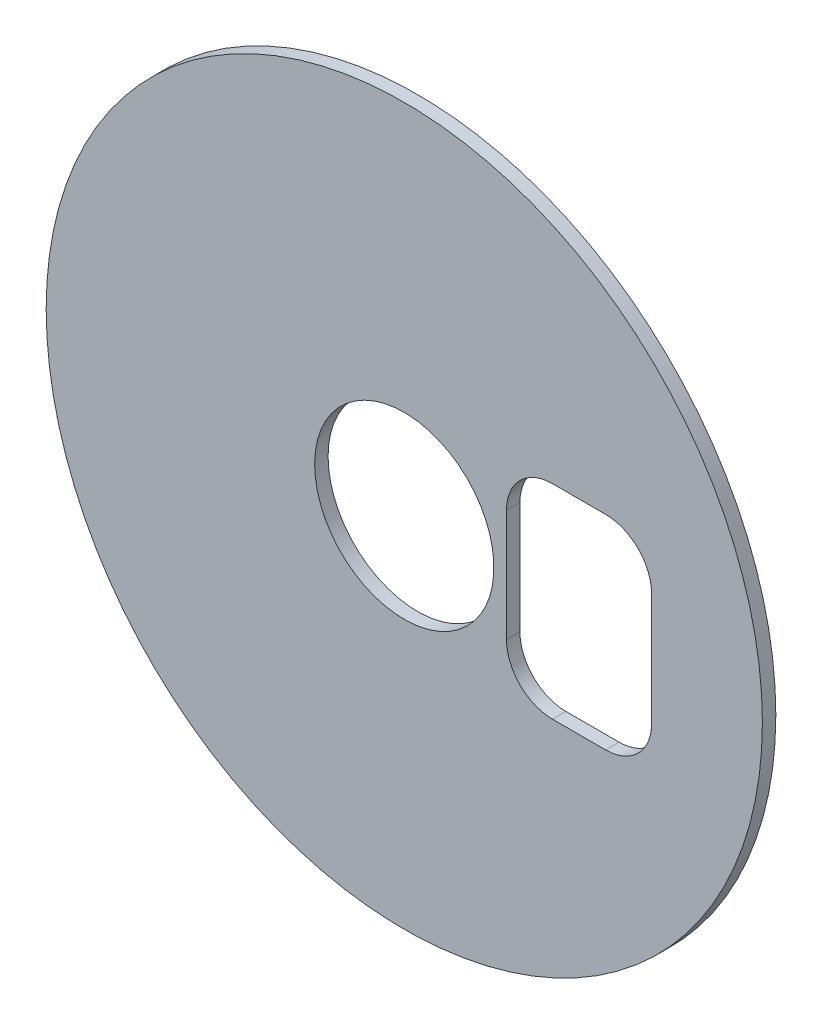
ISO-10303-21;
HEADER;
FILE_DESCRIPTION(('STEP AP214'),'2;1');
FILE_NAME('part.step','',(''),(''),'','','');
FILE_SCHEMA(('AUTOMOTIVE_DESIGN { 1 0 10303 214 1 1 1 1 }'));
ENDSEC;
DATA;
#1=APPLICATION_CONTEXT('core data for automotive mechanical design processes');
#2=APPLICATION_PROTOCOL_DEFINITION('international standard','automotive_design',2000,#1);
#3=PRODUCT_CONTEXT('',#1,'mechanical');
#4=PRODUCT('Part','Part','',(#3));
#5=PRODUCT_RELATED_PRODUCT_CATEGORY('part','',(#4));
#6=PRODUCT_DEFINITION_FORMATION('','',#4);
#7=PRODUCT_DEFINITION_CONTEXT('part definition',#1,'design');
#8=PRODUCT_DEFINITION('design','',#6,#7);
#9=PRODUCT_DEFINITION_SHAPE('','',#8);
#10=(LENGTH_UNIT() NAMED_UNIT(*) SI_UNIT(.MILLI.,.METRE.));
#11=(NAMED_UNIT(*) PLANE_ANGLE_UNIT() SI_UNIT($,.RADIAN.));
#12=(NAMED_UNIT(*) SI_UNIT($,.STERADIAN.) SOLID_ANGLE_UNIT());
#13=UNCERTAINTY_MEASURE_WITH_UNIT(LENGTH_MEASURE(1.E-05),#10,'distance_accuracy_value','');
#14=(GEOMETRIC_REPRESENTATION_CONTEXT(3) GLOBAL_UNCERTAINTY_ASSIGNED_CONTEXT((#13)) GLOBAL_UNIT_ASSIGNED_CONTEXT((#10,
#11,#12)) REPRESENTATION_CONTEXT('',''));
#15=CARTESIAN_POINT('',(0.,0.,0.));
#16=DIRECTION('',(0.,0.,1.));
#17=DIRECTION('',(1.,0.,0.));
#18=AXIS2_PLACEMENT_3D('',#15,#16,#17);
#19=CARTESIAN_POINT('',(0.,0.,0.761999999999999));
#20=DIRECTION('',(0.,0.,1.));
#21=DIRECTION('',(1.,0.,0.));
#22=AXIS2_PLACEMENT_3D('',#19,#20,#21);
#23=PLANE('',#22);
#24=CARTESIAN_POINT('',(0.,0.,0.761999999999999));
#25=DIRECTION('',(0.,0.,1.));
#26=DIRECTION('',(1.,0.,0.));
#27=AXIS2_PLACEMENT_3D('',#24,#25,#26);
#28=CIRCLE('',#27,5.08);
#29=CARTESIAN_POINT('',(-5.08000000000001,0.,0.761999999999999));
#30=VERTEX_POINT('',#29);
#31=EDGE_CURVE('E163',#30,#30,#28,.T.);
#32=ORIENTED_EDGE('',*,*,#31,.F.);
#33=EDGE_LOOP('',(#32));
#34=FACE_BOUND('',#33,.T.);
#35=CARTESIAN_POINT('',(0.,0.,0.761999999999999));
#36=DIRECTION('',(0.,0.,1.));
#37=DIRECTION('',(1.,0.,0.));
#38=AXIS2_PLACEMENT_3D('',#35,#36,#37);
#39=CIRCLE('',#38,20.2946);
#40=CARTESIAN_POINT('',(-20.2946,0.,0.761999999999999));
#41=VERTEX_POINT('',#40);
#42=EDGE_CURVE('E11',#41,#41,#39,.T.);
#43=ORIENTED_EDGE('',*,*,#42,.T.);
#44=EDGE_LOOP('',(#43));
#45=FACE_BOUND('',#44,.T.);
#46=DIRECTION('',(-1.,0.,0.));
#47=VECTOR('',#46,1.);
#48=CARTESIAN_POINT('',(11.41476,5.7798237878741,0.762000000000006));
#49=LINE('',#48,#47);
#50=CARTESIAN_POINT('',(11.41476,5.7798237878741,0.762000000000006));
#51=VERTEX_POINT('',#50);
#52=CARTESIAN_POINT('',(8.39724000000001,5.77982378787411,0.762000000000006));
#53=VERTEX_POINT('',#52);
#54=EDGE_CURVE('E135',#51,#53,#49,.T.);
#55=ORIENTED_EDGE('',*,*,#54,.F.);
#56=CARTESIAN_POINT('',(11.41476,3.17500000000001,0.761999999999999));
#57=DIRECTION('',(0.,0.,1.));
#58=DIRECTION('',(1.,0.,0.));
#59=AXIS2_PLACEMENT_3D('',#56,#57,#58);
#60=CIRCLE('',#59,2.60482378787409);
#61=CARTESIAN_POINT('',(14.0195837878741,3.17500000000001,0.761999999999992));
#62=VERTEX_POINT('',#61);
#63=EDGE_CURVE('E112',#62,#51,#60,.T.);
#64=ORIENTED_EDGE('',*,*,#63,.F.);
#65=DIRECTION('',(0.,1.,0.));
#66=VECTOR('',#65,1.);
#67=CARTESIAN_POINT('',(14.0195837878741,-3.17500000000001,0.761999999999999));
#68=LINE('',#67,#66);
#69=CARTESIAN_POINT('',(14.0195837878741,-3.17500000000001,0.761999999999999));
#70=VERTEX_POINT('',#69);
#71=EDGE_CURVE('E147',#70,#62,#68,.T.);
#72=ORIENTED_EDGE('',*,*,#71,.F.);
#73=CARTESIAN_POINT('',(11.41476,-3.17500000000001,0.762000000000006));
#74=DIRECTION('',(0.,0.,1.));
#75=DIRECTION('',(1.,0.,0.));
#76=AXIS2_PLACEMENT_3D('',#73,#74,#75);
#77=CIRCLE('',#76,2.60482378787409);
#78=CARTESIAN_POINT('',(11.41476,-5.77982378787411,0.762000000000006));
#79=VERTEX_POINT('',#78);
#80=EDGE_CURVE('E145',#79,#70,#77,.T.);
#81=ORIENTED_EDGE('',*,*,#80,.F.);
#82=DIRECTION('',(1.,0.,0.));
#83=VECTOR('',#82,1.);
#84=CARTESIAN_POINT('',(8.39724000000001,-5.7798237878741,0.761999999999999));
#85=LINE('',#84,#83);
#86=CARTESIAN_POINT('',(8.39724000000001,-5.7798237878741,0.761999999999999));
#87=VERTEX_POINT('',#86);
#88=EDGE_CURVE('E143',#87,#79,#85,.T.);
#89=ORIENTED_EDGE('',*,*,#88,.F.);
#90=CARTESIAN_POINT('',(8.39724000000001,-3.175,0.762000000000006));
#91=DIRECTION('',(0.,0.,1.));
#92=DIRECTION('',(1.,0.,0.));
#93=AXIS2_PLACEMENT_3D('',#90,#91,#92);
#94=CIRCLE('',#93,2.60482378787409);
#95=CARTESIAN_POINT('',(5.79241621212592,-3.175,0.762000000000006));
#96=VERTEX_POINT('',#95);
#97=EDGE_CURVE('E141',#96,#87,#94,.T.);
#98=ORIENTED_EDGE('',*,*,#97,.F.);
#99=DIRECTION('',(0.,-1.,0.));
#100=VECTOR('',#99,1.);
#101=CARTESIAN_POINT('',(5.79241621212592,3.17500000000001,0.761999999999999));
#102=LINE('',#101,#100);
#103=CARTESIAN_POINT('',(5.79241621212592,3.17500000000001,0.761999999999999));
#104=VERTEX_POINT('',#103);
#105=EDGE_CURVE('E139',#104,#96,#102,.T.);
#106=ORIENTED_EDGE('',*,*,#105,.F.);
#107=CARTESIAN_POINT('',(8.39724000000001,3.17500000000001,0.761999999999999));
#108=DIRECTION('',(0.,0.,1.));
#109=DIRECTION('',(1.,0.,0.));
#110=AXIS2_PLACEMENT_3D('',#107,#108,#109);
#111=CIRCLE('',#110,2.60482378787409);
#112=EDGE_CURVE('E137',#53,#104,#111,.T.);
#113=ORIENTED_EDGE('',*,*,#112,.F.);
#114=EDGE_LOOP('',(#55,#64,#72,#81,#89,#98,#106,#113));
#115=FACE_BOUND('',#114,.T.);
#116=ADVANCED_FACE('F32',(#34,#45,#115),#23,.T.);
#117=CARTESIAN_POINT('',(0.,0.,0.));
#118=DIRECTION('',(0.,0.,1.));
#119=DIRECTION('',(1.,0.,0.));
#120=AXIS2_PLACEMENT_3D('',#117,#118,#119);
#121=PLANE('',#120);
#122=CARTESIAN_POINT('',(0.,0.,0.));
#123=DIRECTION('',(0.,0.,1.));
#124=DIRECTION('',(1.,0.,0.));
#125=AXIS2_PLACEMENT_3D('',#122,#123,#124);
#126=CIRCLE('',#125,5.08);
#127=CARTESIAN_POINT('',(-5.08000000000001,0.,0.));
#128=VERTEX_POINT('',#127);
#129=EDGE_CURVE('E113',#128,#128,#126,.T.);
#130=ORIENTED_EDGE('',*,*,#129,.T.);
#131=EDGE_LOOP('',(#130));
#132=FACE_BOUND('',#131,.T.);
#133=CARTESIAN_POINT('',(0.,0.,0.));
#134=DIRECTION('',(0.,0.,1.));
#135=DIRECTION('',(1.,0.,0.));
#136=AXIS2_PLACEMENT_3D('',#133,#134,#135);
#137=CIRCLE('',#136,20.2946);
#138=CARTESIAN_POINT('',(-20.2946,0.,0.));
#139=VERTEX_POINT('',#138);
#140=EDGE_CURVE('E40',#139,#139,#137,.T.);
#141=ORIENTED_EDGE('',*,*,#140,.F.);
#142=EDGE_LOOP('',(#141));
#143=FACE_BOUND('',#142,.T.);
#144=CARTESIAN_POINT('',(11.41476,3.17500000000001,0.));
#145=DIRECTION('',(0.,0.,1.));
#146=DIRECTION('',(1.,0.,0.));
#147=AXIS2_PLACEMENT_3D('',#144,#145,#146);
#148=CIRCLE('',#147,2.60482378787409);
#149=CARTESIAN_POINT('',(14.0195837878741,3.17500000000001,0.));
#150=VERTEX_POINT('',#149);
#151=CARTESIAN_POINT('',(11.41476,5.7798237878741,0.));
#152=VERTEX_POINT('',#151);
#153=EDGE_CURVE('E55',#150,#152,#148,.T.);
#154=ORIENTED_EDGE('',*,*,#153,.T.);
#155=DIRECTION('',(-1.,0.,0.));
#156=VECTOR('',#155,1.);
#157=CARTESIAN_POINT('',(11.41476,5.7798237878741,0.));
#158=LINE('',#157,#156);
#159=CARTESIAN_POINT('',(8.39724000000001,5.77982378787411,0.));
#160=VERTEX_POINT('',#159);
#161=EDGE_CURVE('E99',#152,#160,#158,.T.);
#162=ORIENTED_EDGE('',*,*,#161,.T.);
#163=CARTESIAN_POINT('',(8.39724000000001,3.17500000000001,0.));
#164=DIRECTION('',(0.,0.,1.));
#165=DIRECTION('',(1.,0.,0.));
#166=AXIS2_PLACEMENT_3D('',#163,#164,#165);
#167=CIRCLE('',#166,2.60482378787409);
#168=CARTESIAN_POINT('',(5.79241621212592,3.17500000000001,0.));
#169=VERTEX_POINT('',#168);
#170=EDGE_CURVE('E108',#160,#169,#167,.T.);
#171=ORIENTED_EDGE('',*,*,#170,.T.);
#172=DIRECTION('',(0.,-1.,0.));
#173=VECTOR('',#172,1.);
#174=CARTESIAN_POINT('',(5.79241621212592,3.17500000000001,0.));
#175=LINE('',#174,#173);
#176=CARTESIAN_POINT('',(5.79241621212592,-3.175,0.));
#177=VERTEX_POINT('',#176);
#178=EDGE_CURVE('E122',#169,#177,#175,.T.);
#179=ORIENTED_EDGE('',*,*,#178,.T.);
#180=CARTESIAN_POINT('',(8.39724000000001,-3.175,0.));
#181=DIRECTION('',(0.,0.,1.));
#182=DIRECTION('',(1.,0.,0.));
#183=AXIS2_PLACEMENT_3D('',#180,#181,#182);
#184=CIRCLE('',#183,2.60482378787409);
#185=CARTESIAN_POINT('',(8.39724000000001,-5.7798237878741,0.));
#186=VERTEX_POINT('',#185);
#187=EDGE_CURVE('E125',#177,#186,#184,.T.);
#188=ORIENTED_EDGE('',*,*,#187,.T.);
#189=DIRECTION('',(1.,0.,0.));
#190=VECTOR('',#189,1.);
#191=CARTESIAN_POINT('',(8.39724000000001,-5.7798237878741,0.));
#192=LINE('',#191,#190);
#193=CARTESIAN_POINT('',(11.41476,-5.77982378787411,0.));
#194=VERTEX_POINT('',#193);
#195=EDGE_CURVE('E128',#186,#194,#192,.T.);
#196=ORIENTED_EDGE('',*,*,#195,.T.);
#197=CARTESIAN_POINT('',(11.41476,-3.17500000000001,0.));
#198=DIRECTION('',(0.,0.,1.));
#199=DIRECTION('',(1.,0.,0.));
#200=AXIS2_PLACEMENT_3D('',#197,#198,#199);
#201=CIRCLE('',#200,2.60482378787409);
#202=CARTESIAN_POINT('',(14.0195837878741,-3.17500000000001,0.));
#203=VERTEX_POINT('',#202);
#204=EDGE_CURVE('E131',#194,#203,#201,.T.);
#205=ORIENTED_EDGE('',*,*,#204,.T.);
#206=DIRECTION('',(0.,1.,0.));
#207=VECTOR('',#206,1.);
#208=CARTESIAN_POINT('',(14.0195837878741,-3.17500000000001,0.));
#209=LINE('',#208,#207);
#210=EDGE_CURVE('E118',#203,#150,#209,.T.);
#211=ORIENTED_EDGE('',*,*,#210,.T.);
#212=EDGE_LOOP('',(#154,#162,#171,#179,#188,#196,#205,#211));
#213=FACE_BOUND('',#212,.T.);
#214=ADVANCED_FACE('F116',(#132,#143,#213),#121,.F.);
#215=CARTESIAN_POINT('',(0.,0.,0.761999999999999));
#216=DIRECTION('',(0.,0.,-1.));
#217=DIRECTION('',(-1.,0.,0.));
#218=AXIS2_PLACEMENT_3D('',#215,#216,#217);
#219=CYLINDRICAL_SURFACE('',#218,20.2946);
#220=CARTESIAN_POINT('',(-20.2946,0.,0.761999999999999));
#221=CARTESIAN_POINT('',(-20.2946,0.,0.754062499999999));
#222=CARTESIAN_POINT('',(-20.2946,0.,0.746124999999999));
#223=CARTESIAN_POINT('',(-20.2946,0.,0.730249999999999));
#224=CARTESIAN_POINT('',(-20.2946,0.,0.722312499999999));
#225=CARTESIAN_POINT('',(-20.2946,0.,0.706437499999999));
#226=CARTESIAN_POINT('',(-20.2946,0.,0.698499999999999));
#227=CARTESIAN_POINT('',(-20.2946,0.,0.682624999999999));
#228=CARTESIAN_POINT('',(-20.2946,0.,0.674687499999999));
#229=CARTESIAN_POINT('',(-20.2946,0.,0.658812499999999));
#230=CARTESIAN_POINT('',(-20.2946,0.,0.650874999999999));
#231=CARTESIAN_POINT('',(-20.2946,0.,0.634999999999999));
#232=CARTESIAN_POINT('',(-20.2946,0.,0.627062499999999));
#233=CARTESIAN_POINT('',(-20.2946,0.,0.611187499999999));
#234=CARTESIAN_POINT('',(-20.2946,0.,0.603249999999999));
#235=CARTESIAN_POINT('',(-20.2946,0.,0.587374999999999));
#236=CARTESIAN_POINT('',(-20.2946,0.,0.579437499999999));
#237=CARTESIAN_POINT('',(-20.2946,0.,0.563562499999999));
#238=CARTESIAN_POINT('',(-20.2946,0.,0.555624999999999));
#239=CARTESIAN_POINT('',(-20.2946,0.,0.539749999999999));
#240=CARTESIAN_POINT('',(-20.2946,0.,0.531812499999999));
#241=CARTESIAN_POINT('',(-20.2946,0.,0.515937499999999));
#242=CARTESIAN_POINT('',(-20.2946,0.,0.507999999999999));
#243=CARTESIAN_POINT('',(-20.2946,0.,0.492124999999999));
#244=CARTESIAN_POINT('',(-20.2946,0.,0.484187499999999));
#245=CARTESIAN_POINT('',(-20.2946,0.,0.468312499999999));
#246=CARTESIAN_POINT('',(-20.2946,0.,0.460374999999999));
#247=CARTESIAN_POINT('',(-20.2946,0.,0.444499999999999));
#248=CARTESIAN_POINT('',(-20.2946,0.,0.436562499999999));
#249=CARTESIAN_POINT('',(-20.2946,0.,0.420687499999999));
#250=CARTESIAN_POINT('',(-20.2946,0.,0.412749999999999));
#251=CARTESIAN_POINT('',(-20.2946,0.,0.396874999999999));
#252=CARTESIAN_POINT('',(-20.2946,0.,0.388937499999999));
#253=CARTESIAN_POINT('',(-20.2946,0.,0.373062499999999));
#254=CARTESIAN_POINT('',(-20.2946,0.,0.365124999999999));
#255=CARTESIAN_POINT('',(-20.2946,0.,0.34925));
#256=CARTESIAN_POINT('',(-20.2946,0.,0.3413125));
#257=CARTESIAN_POINT('',(-20.2946,0.,0.3254375));
#258=CARTESIAN_POINT('',(-20.2946,0.,0.3175));
#259=CARTESIAN_POINT('',(-20.2946,0.,0.301625));
#260=CARTESIAN_POINT('',(-20.2946,0.,0.2936875));
#261=CARTESIAN_POINT('',(-20.2946,0.,0.2778125));
#262=CARTESIAN_POINT('',(-20.2946,0.,0.269875));
#263=CARTESIAN_POINT('',(-20.2946,0.,0.254));
#264=CARTESIAN_POINT('',(-20.2946,0.,0.2460625));
#265=CARTESIAN_POINT('',(-20.2946,0.,0.2301875));
#266=CARTESIAN_POINT('',(-20.2946,0.,0.22225));
#267=CARTESIAN_POINT('',(-20.2946,0.,0.206375));
#268=CARTESIAN_POINT('',(-20.2946,0.,0.1984375));
#269=CARTESIAN_POINT('',(-20.2946,0.,0.1825625));
#270=CARTESIAN_POINT('',(-20.2946,0.,0.174625));
#271=CARTESIAN_POINT('',(-20.2946,0.,0.15875));
#272=CARTESIAN_POINT('',(-20.2946,0.,0.1508125));
#273=CARTESIAN_POINT('',(-20.2946,0.,0.1349375));
#274=CARTESIAN_POINT('',(-20.2946,0.,0.127));
#275=CARTESIAN_POINT('',(-20.2946,0.,0.111125));
#276=CARTESIAN_POINT('',(-20.2946,0.,0.1031875));
#277=CARTESIAN_POINT('',(-20.2946,0.,0.0873125));
#278=CARTESIAN_POINT('',(-20.2946,0.,0.079375));
#279=CARTESIAN_POINT('',(-20.2946,0.,0.0635));
#280=CARTESIAN_POINT('',(-20.2946,0.,0.0555625));
#281=CARTESIAN_POINT('',(-20.2946,0.,0.0396875));
#282=CARTESIAN_POINT('',(-20.2946,0.,0.0317500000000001));
#283=CARTESIAN_POINT('',(-20.2946,0.,0.0158750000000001));
#284=CARTESIAN_POINT('',(-20.2946,0.,0.0079375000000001));
#285=CARTESIAN_POINT('',(-20.2946,0.,0.));
#286=B_SPLINE_CURVE_WITH_KNOTS('',3,(#220,#221,#222,#223,#224,#225,#226,#227,#228,#229,#230,
#231,#232,#233,#234,#235,#236,#237,#238,#239,#240,#241,#242,#243,#244,#245,#246,#247,#248,#249,
#250,#251,#252,#253,#254,#255,#256,#257,#258,#259,#260,#261,#262,#263,#264,#265,#266,#267,#268,
#269,#270,#271,#272,#273,#274,#275,#276,#277,#278,#279,#280,#281,#282,#283,#284,#285),
.UNSPECIFIED.,.F.,.F.,(4,2,2,2,2,2,2,2,2,2,2,2,2,2,2,2,2,2,2,2,2,2,2,2,2,2,2,2,2,2,2,2,4),(0.,
0.0238125,0.0476249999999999,0.0714374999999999,0.0952499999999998,0.1190625,0.142875,0.1666875,
0.1905,0.2143125,0.238125,0.2619375,0.28575,0.309562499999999,0.333374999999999,
0.357187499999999,0.380999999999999,0.404812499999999,0.428624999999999,0.452437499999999,
0.476249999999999,0.500062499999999,0.523874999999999,0.547687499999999,0.571499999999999,
0.595312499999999,0.619124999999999,0.642937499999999,0.666749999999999,0.690562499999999,
0.714374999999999,0.738187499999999,0.761999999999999),.UNSPECIFIED.);
#287=EDGE_CURVE('BSEAM34',#41,#139,#286,.T.);
#288=ORIENTED_EDGE('',*,*,#42,.F.);
#289=ORIENTED_EDGE('',*,*,#140,.T.);
#290=ORIENTED_EDGE('',*,*,#287,.T.);
#291=ORIENTED_EDGE('',*,*,#287,.F.);
#292=EDGE_LOOP('',(#288,#290,#289,#291));
#293=FACE_BOUND('',#292,.T.);
#294=ADVANCED_FACE('F34',(#293),#219,.T.);
#295=CARTESIAN_POINT('',(0.,0.,0.761999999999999));
#296=DIRECTION('',(0.,0.,-1.));
#297=DIRECTION('',(-1.,0.,0.));
#298=AXIS2_PLACEMENT_3D('',#295,#296,#297);
#299=CYLINDRICAL_SURFACE('',#298,5.08);
#300=CARTESIAN_POINT('',(-5.08000000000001,0.,0.761999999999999));
#301=CARTESIAN_POINT('',(-5.08000000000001,0.,0.754062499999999));
#302=CARTESIAN_POINT('',(-5.08000000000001,0.,0.746124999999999));
#303=CARTESIAN_POINT('',(-5.08000000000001,0.,0.730249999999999));
#304=CARTESIAN_POINT('',(-5.08000000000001,0.,0.722312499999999));
#305=CARTESIAN_POINT('',(-5.08000000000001,0.,0.706437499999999));
#306=CARTESIAN_POINT('',(-5.08000000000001,0.,0.698499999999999));
#307=CARTESIAN_POINT('',(-5.08000000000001,0.,0.682624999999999));
#308=CARTESIAN_POINT('',(-5.08000000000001,0.,0.674687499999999));
#309=CARTESIAN_POINT('',(-5.08000000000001,0.,0.658812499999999));
#310=CARTESIAN_POINT('',(-5.08000000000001,0.,0.650874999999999));
#311=CARTESIAN_POINT('',(-5.08000000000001,0.,0.634999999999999));
#312=CARTESIAN_POINT('',(-5.08000000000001,0.,0.627062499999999));
#313=CARTESIAN_POINT('',(-5.08000000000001,0.,0.611187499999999));
#314=CARTESIAN_POINT('',(-5.08000000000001,0.,0.603249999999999));
#315=CARTESIAN_POINT('',(-5.08000000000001,0.,0.587374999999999));
#316=CARTESIAN_POINT('',(-5.08000000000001,0.,0.579437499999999));
#317=CARTESIAN_POINT('',(-5.08000000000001,0.,0.563562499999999));
#318=CARTESIAN_POINT('',(-5.08000000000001,0.,0.555624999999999));
#319=CARTESIAN_POINT('',(-5.08000000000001,0.,0.539749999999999));
#320=CARTESIAN_POINT('',(-5.08000000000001,0.,0.531812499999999));
#321=CARTESIAN_POINT('',(-5.08000000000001,0.,0.515937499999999));
#322=CARTESIAN_POINT('',(-5.08000000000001,0.,0.507999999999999));
#323=CARTESIAN_POINT('',(-5.08000000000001,0.,0.492124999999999));
#324=CARTESIAN_POINT('',(-5.08000000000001,0.,0.484187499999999));
#325=CARTESIAN_POINT('',(-5.08000000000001,0.,0.468312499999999));
#326=CARTESIAN_POINT('',(-5.08000000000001,0.,0.460374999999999));
#327=CARTESIAN_POINT('',(-5.08000000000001,0.,0.444499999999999));
#328=CARTESIAN_POINT('',(-5.08000000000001,0.,0.436562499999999));
#329=CARTESIAN_POINT('',(-5.08000000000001,0.,0.420687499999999));
#330=CARTESIAN_POINT('',(-5.08000000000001,0.,0.412749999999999));
#331=CARTESIAN_POINT('',(-5.08000000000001,0.,0.396874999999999));
#332=CARTESIAN_POINT('',(-5.08000000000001,0.,0.388937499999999));
#333=CARTESIAN_POINT('',(-5.08000000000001,0.,0.373062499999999));
#334=CARTESIAN_POINT('',(-5.08000000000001,0.,0.365124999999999));
#335=CARTESIAN_POINT('',(-5.08000000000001,0.,0.34925));
#336=CARTESIAN_POINT('',(-5.08000000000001,0.,0.3413125));
#337=CARTESIAN_POINT('',(-5.08000000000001,0.,0.3254375));
#338=CARTESIAN_POINT('',(-5.08000000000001,0.,0.3175));
#339=CARTESIAN_POINT('',(-5.08000000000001,0.,0.301625));
#340=CARTESIAN_POINT('',(-5.08000000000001,0.,0.2936875));
#341=CARTESIAN_POINT('',(-5.08000000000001,0.,0.2778125));
#342=CARTESIAN_POINT('',(-5.08000000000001,0.,0.269875));
#343=CARTESIAN_POINT('',(-5.08000000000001,0.,0.254));
#344=CARTESIAN_POINT('',(-5.08000000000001,0.,0.2460625));
#345=CARTESIAN_POINT('',(-5.08000000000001,0.,0.2301875));
#346=CARTESIAN_POINT('',(-5.08000000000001,0.,0.22225));
#347=CARTESIAN_POINT('',(-5.08000000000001,0.,0.206375));
#348=CARTESIAN_POINT('',(-5.08000000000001,0.,0.1984375));
#349=CARTESIAN_POINT('',(-5.08000000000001,0.,0.1825625));
#350=CARTESIAN_POINT('',(-5.08000000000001,0.,0.174625));
#351=CARTESIAN_POINT('',(-5.08000000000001,0.,0.15875));
#352=CARTESIAN_POINT('',(-5.08000000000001,0.,0.1508125));
#353=CARTESIAN_POINT('',(-5.08000000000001,0.,0.1349375));
#354=CARTESIAN_POINT('',(-5.08000000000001,0.,0.127));
#355=CARTESIAN_POINT('',(-5.08000000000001,0.,0.111125));
#356=CARTESIAN_POINT('',(-5.08000000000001,0.,0.1031875));
#357=CARTESIAN_POINT('',(-5.08000000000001,0.,0.0873125));
#358=CARTESIAN_POINT('',(-5.08000000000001,0.,0.079375));
#359=CARTESIAN_POINT('',(-5.08000000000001,0.,0.0635));
#360=CARTESIAN_POINT('',(-5.08000000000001,0.,0.0555625));
#361=CARTESIAN_POINT('',(-5.08000000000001,0.,0.0396875));
#362=CARTESIAN_POINT('',(-5.08000000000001,0.,0.0317500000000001));
#363=CARTESIAN_POINT('',(-5.08000000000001,0.,0.0158750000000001));
#364=CARTESIAN_POINT('',(-5.08000000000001,0.,0.0079375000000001));
#365=CARTESIAN_POINT('',(-5.08000000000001,0.,0.));
#366=B_SPLINE_CURVE_WITH_KNOTS('',3,(#300,#301,#302,#303,#304,#305,#306,#307,#308,#309,#310,
#311,#312,#313,#314,#315,#316,#317,#318,#319,#320,#321,#322,#323,#324,#325,#326,#327,#328,#329,
#330,#331,#332,#333,#334,#335,#336,#337,#338,#339,#340,#341,#342,#343,#344,#345,#346,#347,#348,
#349,#350,#351,#352,#353,#354,#355,#356,#357,#358,#359,#360,#361,#362,#363,#364,#365),
.UNSPECIFIED.,.F.,.F.,(4,2,2,2,2,2,2,2,2,2,2,2,2,2,2,2,2,2,2,2,2,2,2,2,2,2,2,2,2,2,2,2,4),(0.,
0.0238125,0.0476249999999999,0.0714374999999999,0.0952499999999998,0.1190625,0.142875,0.1666875,
0.1905,0.2143125,0.238125,0.2619375,0.28575,0.309562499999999,0.333374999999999,
0.357187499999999,0.380999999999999,0.404812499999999,0.428624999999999,0.452437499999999,
0.476249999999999,0.500062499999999,0.523874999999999,0.547687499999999,0.571499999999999,
0.595312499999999,0.619124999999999,0.642937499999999,0.666749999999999,0.690562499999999,
0.714374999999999,0.738187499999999,0.761999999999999),.UNSPECIFIED.);
#367=EDGE_CURVE('BSEAM176',#30,#128,#366,.T.);
#368=ORIENTED_EDGE('',*,*,#31,.T.);
#369=ORIENTED_EDGE('',*,*,#129,.F.);
#370=ORIENTED_EDGE('',*,*,#367,.T.);
#371=ORIENTED_EDGE('',*,*,#367,.F.);
#372=EDGE_LOOP('',(#368,#370,#369,#371));
#373=FACE_BOUND('',#372,.T.);
#374=ADVANCED_FACE('F176',(#373),#299,.F.);
#375=CARTESIAN_POINT('',(11.41476,3.17500000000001,0.761999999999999));
#376=DIRECTION('',(0.,0.,-1.));
#377=DIRECTION('',(-1.,0.,0.));
#378=AXIS2_PLACEMENT_3D('',#375,#376,#377);
#379=CYLINDRICAL_SURFACE('',#378,2.60482378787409);
#380=ORIENTED_EDGE('',*,*,#153,.F.);
#381=DIRECTION('',(0.,0.,-1.));
#382=VECTOR('',#381,1.);
#383=CARTESIAN_POINT('',(14.0195837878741,3.17500000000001,0.761999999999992));
#384=LINE('',#383,#382);
#385=EDGE_CURVE('E149',#62,#150,#384,.T.);
#386=ORIENTED_EDGE('',*,*,#385,.F.);
#387=ORIENTED_EDGE('',*,*,#63,.T.);
#388=DIRECTION('',(0.,0.,-1.));
#389=VECTOR('',#388,1.);
#390=CARTESIAN_POINT('',(11.41476,5.7798237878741,0.762000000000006));
#391=LINE('',#390,#389);
#392=EDGE_CURVE('E101',#51,#152,#391,.T.);
#393=ORIENTED_EDGE('',*,*,#392,.T.);
#394=EDGE_LOOP('',(#380,#386,#387,#393));
#395=FACE_BOUND('',#394,.T.);
#396=ADVANCED_FACE('F110',(#395),#379,.F.);
#397=CARTESIAN_POINT('',(11.41476,5.7798237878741,0.762000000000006));
#398=DIRECTION('',(0.,-1.,0.));
#399=DIRECTION('',(0.,0.,-1.));
#400=AXIS2_PLACEMENT_3D('',#397,#398,#399);
#401=PLANE('',#400);
#402=ORIENTED_EDGE('',*,*,#161,.F.);
#403=ORIENTED_EDGE('',*,*,#392,.F.);
#404=ORIENTED_EDGE('',*,*,#54,.T.);
#405=DIRECTION('',(0.,0.,-1.));
#406=VECTOR('',#405,1.);
#407=CARTESIAN_POINT('',(8.39724000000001,5.77982378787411,0.762000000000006));
#408=LINE('',#407,#406);
#409=EDGE_CURVE('E104',#53,#160,#408,.T.);
#410=ORIENTED_EDGE('',*,*,#409,.T.);
#411=EDGE_LOOP('',(#402,#403,#404,#410));
#412=FACE_BOUND('',#411,.T.);
#413=ADVANCED_FACE('F100',(#412),#401,.T.);
#414=CARTESIAN_POINT('',(8.39724000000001,3.17500000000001,0.761999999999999));
#415=DIRECTION('',(0.,0.,-1.));
#416=DIRECTION('',(-1.,0.,0.));
#417=AXIS2_PLACEMENT_3D('',#414,#415,#416);
#418=CYLINDRICAL_SURFACE('',#417,2.60482378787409);
#419=ORIENTED_EDGE('',*,*,#170,.F.);
#420=ORIENTED_EDGE('',*,*,#409,.F.);
#421=ORIENTED_EDGE('',*,*,#112,.T.);
#422=DIRECTION('',(0.,0.,-1.));
#423=VECTOR('',#422,1.);
#424=CARTESIAN_POINT('',(5.79241621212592,3.17500000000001,0.761999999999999));
#425=LINE('',#424,#423);
#426=EDGE_CURVE('E158',#104,#169,#425,.T.);
#427=ORIENTED_EDGE('',*,*,#426,.T.);
#428=EDGE_LOOP('',(#419,#420,#421,#427));
#429=FACE_BOUND('',#428,.T.);
#430=ADVANCED_FACE('F187',(#429),#418,.F.);
#431=CARTESIAN_POINT('',(5.79241621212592,3.17500000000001,0.761999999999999));
#432=DIRECTION('',(1.,0.,0.));
#433=DIRECTION('',(0.,1.,0.));
#434=AXIS2_PLACEMENT_3D('',#431,#432,#433);
#435=PLANE('',#434);
#436=ORIENTED_EDGE('',*,*,#178,.F.);
#437=ORIENTED_EDGE('',*,*,#426,.F.);
#438=ORIENTED_EDGE('',*,*,#105,.T.);
#439=DIRECTION('',(0.,0.,-1.));
#440=VECTOR('',#439,1.);
#441=CARTESIAN_POINT('',(5.79241621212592,-3.175,0.762000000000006));
#442=LINE('',#441,#440);
#443=EDGE_CURVE('E156',#96,#177,#442,.T.);
#444=ORIENTED_EDGE('',*,*,#443,.T.);
#445=EDGE_LOOP('',(#436,#437,#438,#444));
#446=FACE_BOUND('',#445,.T.);
#447=ADVANCED_FACE('F190',(#446),#435,.T.);
#448=CARTESIAN_POINT('',(8.39724000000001,-3.175,0.762000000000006));
#449=DIRECTION('',(0.,0.,-1.));
#450=DIRECTION('',(-1.,0.,0.));
#451=AXIS2_PLACEMENT_3D('',#448,#449,#450);
#452=CYLINDRICAL_SURFACE('',#451,2.60482378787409);
#453=ORIENTED_EDGE('',*,*,#187,.F.);
#454=ORIENTED_EDGE('',*,*,#443,.F.);
#455=ORIENTED_EDGE('',*,*,#97,.T.);
#456=DIRECTION('',(0.,0.,-1.));
#457=VECTOR('',#456,1.);
#458=CARTESIAN_POINT('',(8.39724000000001,-5.7798237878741,0.761999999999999));
#459=LINE('',#458,#457);
#460=EDGE_CURVE('E154',#87,#186,#459,.T.);
#461=ORIENTED_EDGE('',*,*,#460,.T.);
#462=EDGE_LOOP('',(#453,#454,#455,#461));
#463=FACE_BOUND('',#462,.T.);
#464=ADVANCED_FACE('F194',(#463),#452,.F.);
#465=CARTESIAN_POINT('',(8.39724000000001,-5.7798237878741,0.761999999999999));
#466=DIRECTION('',(0.,1.,0.));
#467=DIRECTION('',(-1.,0.,0.));
#468=AXIS2_PLACEMENT_3D('',#465,#466,#467);
#469=PLANE('',#468);
#470=ORIENTED_EDGE('',*,*,#195,.F.);
#471=ORIENTED_EDGE('',*,*,#460,.F.);
#472=ORIENTED_EDGE('',*,*,#88,.T.);
#473=DIRECTION('',(0.,0.,-1.));
#474=VECTOR('',#473,1.);
#475=CARTESIAN_POINT('',(11.41476,-5.77982378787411,0.762000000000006));
#476=LINE('',#475,#474);
#477=EDGE_CURVE('E152',#79,#194,#476,.T.);
#478=ORIENTED_EDGE('',*,*,#477,.T.);
#479=EDGE_LOOP('',(#470,#471,#472,#478));
#480=FACE_BOUND('',#479,.T.);
#481=ADVANCED_FACE('F198',(#480),#469,.T.);
#482=CARTESIAN_POINT('',(11.41476,-3.17500000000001,0.762000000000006));
#483=DIRECTION('',(0.,0.,-1.));
#484=DIRECTION('',(-1.,0.,0.));
#485=AXIS2_PLACEMENT_3D('',#482,#483,#484);
#486=CYLINDRICAL_SURFACE('',#485,2.60482378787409);
#487=ORIENTED_EDGE('',*,*,#204,.F.);
#488=ORIENTED_EDGE('',*,*,#477,.F.);
#489=ORIENTED_EDGE('',*,*,#80,.T.);
#490=DIRECTION('',(0.,0.,-1.));
#491=VECTOR('',#490,1.);
#492=CARTESIAN_POINT('',(14.0195837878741,-3.17500000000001,0.761999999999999));
#493=LINE('',#492,#491);
#494=EDGE_CURVE('E47',#70,#203,#493,.T.);
#495=ORIENTED_EDGE('',*,*,#494,.T.);
#496=EDGE_LOOP('',(#487,#488,#489,#495));
#497=FACE_BOUND('',#496,.T.);
#498=ADVANCED_FACE('F202',(#497),#486,.F.);
#499=CARTESIAN_POINT('',(14.0195837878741,-3.17500000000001,0.761999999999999));
#500=DIRECTION('',(-1.,0.,0.));
#501=DIRECTION('',(0.,0.,1.));
#502=AXIS2_PLACEMENT_3D('',#499,#500,#501);
#503=PLANE('',#502);
#504=ORIENTED_EDGE('',*,*,#210,.F.);
#505=ORIENTED_EDGE('',*,*,#494,.F.);
#506=ORIENTED_EDGE('',*,*,#71,.T.);
#507=ORIENTED_EDGE('',*,*,#385,.T.);
#508=EDGE_LOOP('',(#504,#505,#506,#507));
#509=FACE_BOUND('',#508,.T.);
#510=ADVANCED_FACE('F206',(#509),#503,.T.);
#511=CLOSED_SHELL('',(#116,#214,#294,#374,#396,#413,#430,#447,#464,#481,#498,#510));
#512=MANIFOLD_SOLID_BREP('B2',#511);
#513=ADVANCED_BREP_SHAPE_REPRESENTATION('',(#18,#512),#14);
#514=SHAPE_DEFINITION_REPRESENTATION(#9,#513);
ENDSEC;
END-ISO-10303-21;
